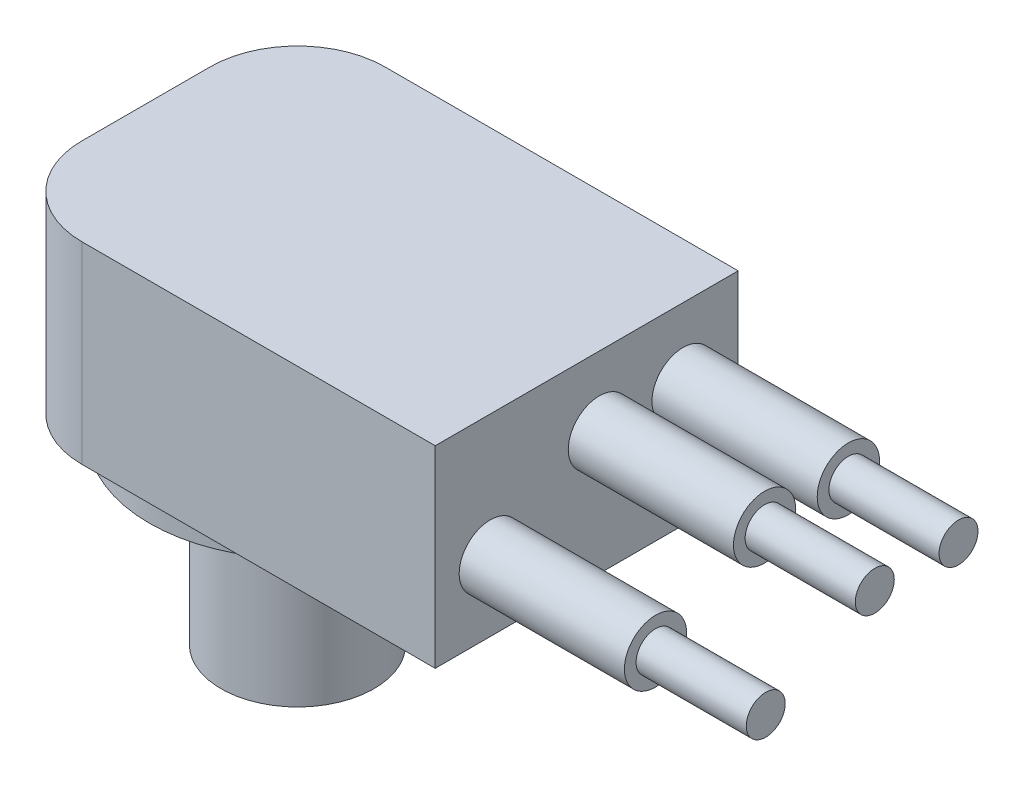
ISO-10303-21;
HEADER;
FILE_DESCRIPTION(('STEP AP214'),'2;1');
FILE_NAME('part.step','',(''),(''),'','','');
FILE_SCHEMA(('AUTOMOTIVE_DESIGN { 1 0 10303 214 1 1 1 1 }'));
ENDSEC;
DATA;
#1=APPLICATION_CONTEXT('core data for automotive mechanical design processes');
#2=APPLICATION_PROTOCOL_DEFINITION('international standard','automotive_design',2000,#1);
#3=PRODUCT_CONTEXT('',#1,'mechanical');
#4=PRODUCT('Part','Part','',(#3));
#5=PRODUCT_RELATED_PRODUCT_CATEGORY('part','',(#4));
#6=PRODUCT_DEFINITION_FORMATION('','',#4);
#7=PRODUCT_DEFINITION_CONTEXT('part definition',#1,'design');
#8=PRODUCT_DEFINITION('design','',#6,#7);
#9=PRODUCT_DEFINITION_SHAPE('','',#8);
#10=(LENGTH_UNIT() NAMED_UNIT(*) SI_UNIT(.MILLI.,.METRE.));
#11=(NAMED_UNIT(*) PLANE_ANGLE_UNIT() SI_UNIT($,.RADIAN.));
#12=(NAMED_UNIT(*) SI_UNIT($,.STERADIAN.) SOLID_ANGLE_UNIT());
#13=UNCERTAINTY_MEASURE_WITH_UNIT(LENGTH_MEASURE(1.E-05),#10,'distance_accuracy_value','');
#14=(GEOMETRIC_REPRESENTATION_CONTEXT(3) GLOBAL_UNCERTAINTY_ASSIGNED_CONTEXT((#13)) GLOBAL_UNIT_ASSIGNED_CONTEXT((#10,
#11,#12)) REPRESENTATION_CONTEXT('',''));
#15=CARTESIAN_POINT('',(0.,0.,0.));
#16=DIRECTION('',(0.,0.,1.));
#17=DIRECTION('',(1.,0.,0.));
#18=AXIS2_PLACEMENT_3D('',#15,#16,#17);
#19=CARTESIAN_POINT('',(11.,-1.5,0.));
#20=DIRECTION('',(0.,-1.,0.));
#21=DIRECTION('',(0.,0.,-1.));
#22=AXIS2_PLACEMENT_3D('',#19,#20,#21);
#23=PLANE('',#22);
#24=CARTESIAN_POINT('',(11.,-1.5,0.));
#25=DIRECTION('',(0.,-1.,0.));
#26=DIRECTION('',(0.,0.,-1.));
#27=AXIS2_PLACEMENT_3D('',#24,#25,#26);
#28=CIRCLE('',#27,10.755);
#29=CARTESIAN_POINT('',(11.,-1.5,-10.755));
#30=VERTEX_POINT('',#29);
#31=EDGE_CURVE('E129',#30,#30,#28,.T.);
#32=ORIENTED_EDGE('',*,*,#31,.T.);
#33=EDGE_LOOP('',(#32));
#34=FACE_BOUND('',#33,.T.);
#35=CARTESIAN_POINT('',(11.,-1.5,0.));
#36=DIRECTION('',(0.,-1.,0.));
#37=DIRECTION('',(0.,0.,-1.));
#38=AXIS2_PLACEMENT_3D('',#35,#36,#37);
#39=CIRCLE('',#38,7.99);
#40=CARTESIAN_POINT('',(11.,-1.5,-7.99));
#41=VERTEX_POINT('',#40);
#42=EDGE_CURVE('E42',#41,#41,#39,.F.);
#43=ORIENTED_EDGE('',*,*,#42,.T.);
#44=EDGE_LOOP('',(#43));
#45=FACE_BOUND('',#44,.T.);
#46=ADVANCED_FACE('F38',(#34,#45),#23,.T.);
#47=CARTESIAN_POINT('',(0.,0.,11.));
#48=DIRECTION('',(0.,1.,0.));
#49=DIRECTION('',(0.,0.,1.));
#50=AXIS2_PLACEMENT_3D('',#47,#48,#49);
#51=PLANE('',#50);
#52=DIRECTION('',(1.,0.,0.));
#53=VECTOR('',#52,1.);
#54=CARTESIAN_POINT('',(0.,0.,11.));
#55=LINE('',#54,#53);
#56=CARTESIAN_POINT('',(6.35,0.,11.));
#57=VERTEX_POINT('',#56);
#58=CARTESIAN_POINT('',(32.,0.,11.));
#59=VERTEX_POINT('',#58);
#60=EDGE_CURVE('E96',#57,#59,#55,.T.);
#61=ORIENTED_EDGE('',*,*,#60,.F.);
#62=CARTESIAN_POINT('',(6.35,0.,4.65));
#63=DIRECTION('',(0.,1.,0.));
#64=DIRECTION('',(0.,0.,1.));
#65=AXIS2_PLACEMENT_3D('',#62,#63,#64);
#66=CIRCLE('',#65,6.35);
#67=CARTESIAN_POINT('',(0.,0.,4.65));
#68=VERTEX_POINT('',#67);
#69=EDGE_CURVE('E142',#57,#68,#66,.F.);
#70=ORIENTED_EDGE('',*,*,#69,.T.);
#71=DIRECTION('',(0.,0.,-1.));
#72=VECTOR('',#71,1.);
#73=CARTESIAN_POINT('',(0.,0.,11.));
#74=LINE('',#73,#72);
#75=CARTESIAN_POINT('',(0.,0.,-4.65));
#76=VERTEX_POINT('',#75);
#77=EDGE_CURVE('E115',#68,#76,#74,.T.);
#78=ORIENTED_EDGE('',*,*,#77,.T.);
#79=CARTESIAN_POINT('',(6.35,0.,-4.65));
#80=DIRECTION('',(0.,1.,0.));
#81=DIRECTION('',(0.,0.,1.));
#82=AXIS2_PLACEMENT_3D('',#79,#80,#81);
#83=CIRCLE('',#82,6.35);
#84=CARTESIAN_POINT('',(6.35,0.,-11.));
#85=VERTEX_POINT('',#84);
#86=EDGE_CURVE('E140',#76,#85,#83,.F.);
#87=ORIENTED_EDGE('',*,*,#86,.T.);
#88=DIRECTION('',(1.,0.,0.));
#89=VECTOR('',#88,1.);
#90=CARTESIAN_POINT('',(0.,0.,-11.));
#91=LINE('',#90,#89);
#92=CARTESIAN_POINT('',(32.,0.,-11.));
#93=VERTEX_POINT('',#92);
#94=EDGE_CURVE('E112',#85,#93,#91,.T.);
#95=ORIENTED_EDGE('',*,*,#94,.T.);
#96=DIRECTION('',(0.,0.,-1.));
#97=VECTOR('',#96,1.);
#98=CARTESIAN_POINT('',(32.,0.,11.));
#99=LINE('',#98,#97);
#100=EDGE_CURVE('E109',#59,#93,#99,.T.);
#101=ORIENTED_EDGE('',*,*,#100,.F.);
#102=EDGE_LOOP('',(#61,#70,#78,#87,#95,#101));
#103=FACE_BOUND('',#102,.T.);
#104=CARTESIAN_POINT('',(11.,0.,0.));
#105=DIRECTION('',(0.,1.,0.));
#106=DIRECTION('',(0.,0.,1.));
#107=AXIS2_PLACEMENT_3D('',#104,#105,#106);
#108=CIRCLE('',#107,10.755);
#109=CARTESIAN_POINT('',(11.,0.,10.755));
#110=VERTEX_POINT('',#109);
#111=EDGE_CURVE('E136',#110,#110,#108,.F.);
#112=ORIENTED_EDGE('',*,*,#111,.F.);
#113=EDGE_LOOP('',(#112));
#114=FACE_BOUND('',#113,.T.);
#115=ADVANCED_FACE('F110',(#103,#114),#51,.F.);
#116=CARTESIAN_POINT('',(0.,0.,11.));
#117=DIRECTION('',(1.,0.,0.));
#118=DIRECTION('',(0.,0.,-1.));
#119=AXIS2_PLACEMENT_3D('',#116,#117,#118);
#120=PLANE('',#119);
#121=ORIENTED_EDGE('',*,*,#77,.F.);
#122=DIRECTION('',(0.,-1.,0.));
#123=VECTOR('',#122,1.);
#124=CARTESIAN_POINT('',(0.,0.,4.65));
#125=LINE('',#124,#123);
#126=CARTESIAN_POINT('',(0.,14.,4.65));
#127=VERTEX_POINT('',#126);
#128=EDGE_CURVE('E147',#68,#127,#125,.F.);
#129=ORIENTED_EDGE('',*,*,#128,.T.);
#130=DIRECTION('',(0.,0.,-1.));
#131=VECTOR('',#130,1.);
#132=CARTESIAN_POINT('',(0.,14.,11.));
#133=LINE('',#132,#131);
#134=CARTESIAN_POINT('',(0.,14.,-4.65));
#135=VERTEX_POINT('',#134);
#136=EDGE_CURVE('E123',#127,#135,#133,.T.);
#137=ORIENTED_EDGE('',*,*,#136,.T.);
#138=DIRECTION('',(0.,-1.,0.));
#139=VECTOR('',#138,1.);
#140=CARTESIAN_POINT('',(0.,0.,-4.65));
#141=LINE('',#140,#139);
#142=EDGE_CURVE('E144',#135,#76,#141,.T.);
#143=ORIENTED_EDGE('',*,*,#142,.T.);
#144=EDGE_LOOP('',(#121,#129,#137,#143));
#145=FACE_BOUND('',#144,.T.);
#146=ADVANCED_FACE('F211',(#145),#120,.F.);
#147=CARTESIAN_POINT('',(32.,0.,11.));
#148=DIRECTION('',(-1.,0.,0.));
#149=DIRECTION('',(0.,0.,1.));
#150=AXIS2_PLACEMENT_3D('',#147,#148,#149);
#151=PLANE('',#150);
#152=CARTESIAN_POINT('',(32.,8.92,-0.919999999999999));
#153=DIRECTION('',(-1.,0.,0.));
#154=DIRECTION('',(0.,0.,1.));
#155=AXIS2_PLACEMENT_3D('',#152,#153,#154);
#156=CIRCLE('',#155,2.261);
#157=CARTESIAN_POINT('',(32.,8.92,1.341));
#158=VERTEX_POINT('',#157);
#159=EDGE_CURVE('E11',#158,#158,#156,.F.);
#160=ORIENTED_EDGE('',*,*,#159,.F.);
#161=EDGE_LOOP('',(#160));
#162=FACE_BOUND('',#161,.T.);
#163=CARTESIAN_POINT('',(32.,5.08,7.));
#164=DIRECTION('',(-1.,0.,0.));
#165=DIRECTION('',(0.,0.,1.));
#166=AXIS2_PLACEMENT_3D('',#163,#164,#165);
#167=CIRCLE('',#166,2.261);
#168=CARTESIAN_POINT('',(32.,5.08,9.261));
#169=VERTEX_POINT('',#168);
#170=EDGE_CURVE('E47',#169,#169,#167,.F.);
#171=ORIENTED_EDGE('',*,*,#170,.F.);
#172=EDGE_LOOP('',(#171));
#173=FACE_BOUND('',#172,.T.);
#174=CARTESIAN_POINT('',(32.,8.92,-7.));
#175=DIRECTION('',(-1.,0.,0.));
#176=DIRECTION('',(0.,0.,1.));
#177=AXIS2_PLACEMENT_3D('',#174,#175,#176);
#178=CIRCLE('',#177,2.261);
#179=CARTESIAN_POINT('',(32.,8.92,-4.739));
#180=VERTEX_POINT('',#179);
#181=EDGE_CURVE('E153',#180,#180,#178,.F.);
#182=ORIENTED_EDGE('',*,*,#181,.F.);
#183=EDGE_LOOP('',(#182));
#184=FACE_BOUND('',#183,.T.);
#185=DIRECTION('',(0.,1.,0.));
#186=VECTOR('',#185,1.);
#187=CARTESIAN_POINT('',(32.,0.,-11.));
#188=LINE('',#187,#186);
#189=CARTESIAN_POINT('',(32.,14.,-11.));
#190=VERTEX_POINT('',#189);
#191=EDGE_CURVE('E128',#93,#190,#188,.T.);
#192=ORIENTED_EDGE('',*,*,#191,.T.);
#193=DIRECTION('',(0.,0.,-1.));
#194=VECTOR('',#193,1.);
#195=CARTESIAN_POINT('',(32.,14.,11.));
#196=LINE('',#195,#194);
#197=CARTESIAN_POINT('',(32.,14.,11.));
#198=VERTEX_POINT('',#197);
#199=EDGE_CURVE('E116',#198,#190,#196,.T.);
#200=ORIENTED_EDGE('',*,*,#199,.F.);
#201=DIRECTION('',(0.,1.,0.));
#202=VECTOR('',#201,1.);
#203=CARTESIAN_POINT('',(32.,0.,11.));
#204=LINE('',#203,#202);
#205=EDGE_CURVE('E101',#59,#198,#204,.T.);
#206=ORIENTED_EDGE('',*,*,#205,.F.);
#207=ORIENTED_EDGE('',*,*,#100,.T.);
#208=EDGE_LOOP('',(#192,#200,#206,#207));
#209=FACE_BOUND('',#208,.T.);
#210=ADVANCED_FACE('F118',(#162,#173,#184,#209),#151,.F.);
#211=CARTESIAN_POINT('',(0.,14.,11.));
#212=DIRECTION('',(0.,-1.,0.));
#213=DIRECTION('',(0.,0.,-1.));
#214=AXIS2_PLACEMENT_3D('',#211,#212,#213);
#215=PLANE('',#214);
#216=ORIENTED_EDGE('',*,*,#136,.F.);
#217=CARTESIAN_POINT('',(6.35,14.,4.65));
#218=DIRECTION('',(0.,-1.,0.));
#219=DIRECTION('',(0.,0.,-1.));
#220=AXIS2_PLACEMENT_3D('',#217,#218,#219);
#221=CIRCLE('',#220,6.35);
#222=CARTESIAN_POINT('',(6.35,14.,11.));
#223=VERTEX_POINT('',#222);
#224=EDGE_CURVE('E150',#127,#223,#221,.F.);
#225=ORIENTED_EDGE('',*,*,#224,.T.);
#226=DIRECTION('',(-1.,0.,0.));
#227=VECTOR('',#226,1.);
#228=CARTESIAN_POINT('',(0.,14.,11.));
#229=LINE('',#228,#227);
#230=EDGE_CURVE('E121',#198,#223,#229,.T.);
#231=ORIENTED_EDGE('',*,*,#230,.F.);
#232=ORIENTED_EDGE('',*,*,#199,.T.);
#233=DIRECTION('',(-1.,0.,0.));
#234=VECTOR('',#233,1.);
#235=CARTESIAN_POINT('',(0.,14.,-11.));
#236=LINE('',#235,#234);
#237=CARTESIAN_POINT('',(6.35,14.,-11.));
#238=VERTEX_POINT('',#237);
#239=EDGE_CURVE('E106',#190,#238,#236,.T.);
#240=ORIENTED_EDGE('',*,*,#239,.T.);
#241=CARTESIAN_POINT('',(6.35,14.,-4.65));
#242=DIRECTION('',(0.,-1.,0.));
#243=DIRECTION('',(0.,0.,-1.));
#244=AXIS2_PLACEMENT_3D('',#241,#242,#243);
#245=CIRCLE('',#244,6.35);
#246=EDGE_CURVE('E62',#238,#135,#245,.F.);
#247=ORIENTED_EDGE('',*,*,#246,.T.);
#248=EDGE_LOOP('',(#216,#225,#231,#232,#240,#247));
#249=FACE_BOUND('',#248,.T.);
#250=ADVANCED_FACE('F232',(#249),#215,.F.);
#251=CARTESIAN_POINT('',(0.,14.,11.));
#252=DIRECTION('',(0.,0.,-1.));
#253=DIRECTION('',(-1.,0.,0.));
#254=AXIS2_PLACEMENT_3D('',#251,#252,#253);
#255=PLANE('',#254);
#256=ORIENTED_EDGE('',*,*,#230,.T.);
#257=DIRECTION('',(0.,-1.,0.));
#258=VECTOR('',#257,1.);
#259=CARTESIAN_POINT('',(6.35,14.,11.));
#260=LINE('',#259,#258);
#261=EDGE_CURVE('E104',#223,#57,#260,.T.);
#262=ORIENTED_EDGE('',*,*,#261,.T.);
#263=ORIENTED_EDGE('',*,*,#60,.T.);
#264=ORIENTED_EDGE('',*,*,#205,.T.);
#265=EDGE_LOOP('',(#256,#262,#263,#264));
#266=FACE_BOUND('',#265,.T.);
#267=ADVANCED_FACE('F99',(#266),#255,.F.);
#268=CARTESIAN_POINT('',(0.,14.,-11.));
#269=DIRECTION('',(0.,0.,-1.));
#270=DIRECTION('',(-1.,0.,0.));
#271=AXIS2_PLACEMENT_3D('',#268,#269,#270);
#272=PLANE('',#271);
#273=ORIENTED_EDGE('',*,*,#94,.F.);
#274=DIRECTION('',(0.,-1.,0.));
#275=VECTOR('',#274,1.);
#276=CARTESIAN_POINT('',(6.35,14.,-11.));
#277=LINE('',#276,#275);
#278=EDGE_CURVE('E55',#85,#238,#277,.F.);
#279=ORIENTED_EDGE('',*,*,#278,.T.);
#280=ORIENTED_EDGE('',*,*,#239,.F.);
#281=ORIENTED_EDGE('',*,*,#191,.F.);
#282=EDGE_LOOP('',(#273,#279,#280,#281));
#283=FACE_BOUND('',#282,.T.);
#284=ADVANCED_FACE('F207',(#283),#272,.T.);
#285=CARTESIAN_POINT('',(11.,-1.5,0.));
#286=DIRECTION('',(0.,1.,0.));
#287=DIRECTION('',(0.,0.,1.));
#288=AXIS2_PLACEMENT_3D('',#285,#286,#287);
#289=CYLINDRICAL_SURFACE('',#288,10.755);
#290=ORIENTED_EDGE('',*,*,#31,.F.);
#291=EDGE_LOOP('',(#290));
#292=FACE_BOUND('',#291,.T.);
#293=ORIENTED_EDGE('',*,*,#111,.T.);
#294=EDGE_LOOP('',(#293));
#295=FACE_BOUND('',#294,.T.);
#296=ADVANCED_FACE('F203',(#292,#295),#289,.T.);
#297=CARTESIAN_POINT('',(6.35,14.,4.65));
#298=DIRECTION('',(0.,-1.,0.));
#299=DIRECTION('',(0.,0.,-1.));
#300=AXIS2_PLACEMENT_3D('',#297,#298,#299);
#301=CYLINDRICAL_SURFACE('',#300,6.35);
#302=ORIENTED_EDGE('',*,*,#224,.F.);
#303=ORIENTED_EDGE('',*,*,#128,.F.);
#304=ORIENTED_EDGE('',*,*,#69,.F.);
#305=ORIENTED_EDGE('',*,*,#261,.F.);
#306=EDGE_LOOP('',(#302,#303,#304,#305));
#307=FACE_BOUND('',#306,.T.);
#308=ADVANCED_FACE('F206',(#307),#301,.T.);
#309=CARTESIAN_POINT('',(6.35,0.,-4.65));
#310=DIRECTION('',(0.,1.,0.));
#311=DIRECTION('',(0.,0.,1.));
#312=AXIS2_PLACEMENT_3D('',#309,#310,#311);
#313=CYLINDRICAL_SURFACE('',#312,6.35);
#314=ORIENTED_EDGE('',*,*,#246,.F.);
#315=ORIENTED_EDGE('',*,*,#278,.F.);
#316=ORIENTED_EDGE('',*,*,#86,.F.);
#317=ORIENTED_EDGE('',*,*,#142,.F.);
#318=EDGE_LOOP('',(#314,#315,#316,#317));
#319=FACE_BOUND('',#318,.T.);
#320=ADVANCED_FACE('F40',(#319),#313,.T.);
#321=CARTESIAN_POINT('',(44.,8.92,-7.));
#322=DIRECTION('',(-1.,0.,0.));
#323=DIRECTION('',(0.,0.,1.));
#324=AXIS2_PLACEMENT_3D('',#321,#322,#323);
#325=CYLINDRICAL_SURFACE('',#324,2.261);
#326=CARTESIAN_POINT('',(44.,8.92,-7.));
#327=DIRECTION('',(1.,0.,0.));
#328=DIRECTION('',(0.,0.,-1.));
#329=AXIS2_PLACEMENT_3D('',#326,#327,#328);
#330=CIRCLE('',#329,2.261);
#331=CARTESIAN_POINT('',(44.,8.92,-9.261));
#332=VERTEX_POINT('',#331);
#333=EDGE_CURVE('E191',#332,#332,#330,.T.);
#334=ORIENTED_EDGE('',*,*,#333,.F.);
#335=EDGE_LOOP('',(#334));
#336=FACE_BOUND('',#335,.T.);
#337=ORIENTED_EDGE('',*,*,#181,.T.);
#338=EDGE_LOOP('',(#337));
#339=FACE_BOUND('',#338,.T.);
#340=ADVANCED_FACE('F228',(#336,#339),#325,.T.);
#341=CARTESIAN_POINT('',(44.,8.92,-7.));
#342=DIRECTION('',(1.,0.,0.));
#343=DIRECTION('',(0.,0.,-1.));
#344=AXIS2_PLACEMENT_3D('',#341,#342,#343);
#345=PLANE('',#344);
#346=CARTESIAN_POINT('',(44.,8.92,-7.));
#347=DIRECTION('',(1.,0.,0.));
#348=DIRECTION('',(0.,0.,-1.));
#349=AXIS2_PLACEMENT_3D('',#346,#347,#348);
#350=CIRCLE('',#349,1.415);
#351=CARTESIAN_POINT('',(44.,8.92,-8.415));
#352=VERTEX_POINT('',#351);
#353=EDGE_CURVE('E177',#352,#352,#350,.T.);
#354=ORIENTED_EDGE('',*,*,#353,.F.);
#355=EDGE_LOOP('',(#354));
#356=FACE_BOUND('',#355,.T.);
#357=ORIENTED_EDGE('',*,*,#333,.T.);
#358=EDGE_LOOP('',(#357));
#359=FACE_BOUND('',#358,.T.);
#360=ADVANCED_FACE('F255',(#356,#359),#345,.T.);
#361=CARTESIAN_POINT('',(44.,5.08,7.));
#362=DIRECTION('',(-1.,0.,0.));
#363=DIRECTION('',(0.,0.,1.));
#364=AXIS2_PLACEMENT_3D('',#361,#362,#363);
#365=CYLINDRICAL_SURFACE('',#364,2.261);
#366=CARTESIAN_POINT('',(44.,5.08,7.));
#367=DIRECTION('',(1.,0.,0.));
#368=DIRECTION('',(0.,0.,-1.));
#369=AXIS2_PLACEMENT_3D('',#366,#367,#368);
#370=CIRCLE('',#369,2.261);
#371=CARTESIAN_POINT('',(44.,5.08,4.739));
#372=VERTEX_POINT('',#371);
#373=EDGE_CURVE('E188',#372,#372,#370,.T.);
#374=ORIENTED_EDGE('',*,*,#373,.F.);
#375=EDGE_LOOP('',(#374));
#376=FACE_BOUND('',#375,.T.);
#377=ORIENTED_EDGE('',*,*,#170,.T.);
#378=EDGE_LOOP('',(#377));
#379=FACE_BOUND('',#378,.T.);
#380=ADVANCED_FACE('F261',(#376,#379),#365,.T.);
#381=CARTESIAN_POINT('',(44.,5.08,7.));
#382=DIRECTION('',(1.,0.,0.));
#383=DIRECTION('',(0.,0.,-1.));
#384=AXIS2_PLACEMENT_3D('',#381,#382,#383);
#385=PLANE('',#384);
#386=CARTESIAN_POINT('',(44.,5.08,7.));
#387=DIRECTION('',(1.,0.,0.));
#388=DIRECTION('',(0.,0.,-1.));
#389=AXIS2_PLACEMENT_3D('',#386,#387,#388);
#390=CIRCLE('',#389,1.415);
#391=CARTESIAN_POINT('',(44.,5.08,5.585));
#392=VERTEX_POINT('',#391);
#393=EDGE_CURVE('E171',#392,#392,#390,.T.);
#394=ORIENTED_EDGE('',*,*,#393,.F.);
#395=EDGE_LOOP('',(#394));
#396=FACE_BOUND('',#395,.T.);
#397=ORIENTED_EDGE('',*,*,#373,.T.);
#398=EDGE_LOOP('',(#397));
#399=FACE_BOUND('',#398,.T.);
#400=ADVANCED_FACE('F377',(#396,#399),#385,.T.);
#401=CARTESIAN_POINT('',(44.,8.92,-0.919999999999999));
#402=DIRECTION('',(-1.,0.,0.));
#403=DIRECTION('',(0.,0.,1.));
#404=AXIS2_PLACEMENT_3D('',#401,#402,#403);
#405=CYLINDRICAL_SURFACE('',#404,2.261);
#406=CARTESIAN_POINT('',(44.,8.92,-0.919999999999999));
#407=DIRECTION('',(1.,0.,0.));
#408=DIRECTION('',(0.,0.,-1.));
#409=AXIS2_PLACEMENT_3D('',#406,#407,#408);
#410=CIRCLE('',#409,2.261);
#411=CARTESIAN_POINT('',(44.,8.92,-3.181));
#412=VERTEX_POINT('',#411);
#413=EDGE_CURVE('E183',#412,#412,#410,.T.);
#414=ORIENTED_EDGE('',*,*,#413,.F.);
#415=EDGE_LOOP('',(#414));
#416=FACE_BOUND('',#415,.T.);
#417=ORIENTED_EDGE('',*,*,#159,.T.);
#418=EDGE_LOOP('',(#417));
#419=FACE_BOUND('',#418,.T.);
#420=ADVANCED_FACE('F369',(#416,#419),#405,.T.);
#421=CARTESIAN_POINT('',(44.,8.92,-0.919999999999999));
#422=DIRECTION('',(1.,0.,0.));
#423=DIRECTION('',(0.,0.,-1.));
#424=AXIS2_PLACEMENT_3D('',#421,#422,#423);
#425=PLANE('',#424);
#426=CARTESIAN_POINT('',(44.,8.92,-0.919999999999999));
#427=DIRECTION('',(1.,0.,0.));
#428=DIRECTION('',(0.,0.,-1.));
#429=AXIS2_PLACEMENT_3D('',#426,#427,#428);
#430=CIRCLE('',#429,1.415);
#431=CARTESIAN_POINT('',(44.,8.92,-2.335));
#432=VERTEX_POINT('',#431);
#433=EDGE_CURVE('E162',#432,#432,#430,.T.);
#434=ORIENTED_EDGE('',*,*,#433,.F.);
#435=EDGE_LOOP('',(#434));
#436=FACE_BOUND('',#435,.T.);
#437=ORIENTED_EDGE('',*,*,#413,.T.);
#438=EDGE_LOOP('',(#437));
#439=FACE_BOUND('',#438,.T.);
#440=ADVANCED_FACE('F359',(#436,#439),#425,.T.);
#441=CARTESIAN_POINT('',(52.,8.92,-7.));
#442=DIRECTION('',(-1.,0.,0.));
#443=DIRECTION('',(0.,0.,1.));
#444=AXIS2_PLACEMENT_3D('',#441,#442,#443);
#445=CYLINDRICAL_SURFACE('',#444,1.415);
#446=CARTESIAN_POINT('',(52.,8.92,-7.));
#447=DIRECTION('',(1.,0.,0.));
#448=DIRECTION('',(0.,0.,-1.));
#449=AXIS2_PLACEMENT_3D('',#446,#447,#448);
#450=CIRCLE('',#449,1.415);
#451=CARTESIAN_POINT('',(52.,8.92,-8.415));
#452=VERTEX_POINT('',#451);
#453=EDGE_CURVE('E180',#452,#452,#450,.T.);
#454=ORIENTED_EDGE('',*,*,#453,.F.);
#455=EDGE_LOOP('',(#454));
#456=FACE_BOUND('',#455,.T.);
#457=ORIENTED_EDGE('',*,*,#353,.T.);
#458=EDGE_LOOP('',(#457));
#459=FACE_BOUND('',#458,.T.);
#460=ADVANCED_FACE('F349',(#456,#459),#445,.T.);
#461=CARTESIAN_POINT('',(52.,8.92,-7.));
#462=DIRECTION('',(1.,0.,0.));
#463=DIRECTION('',(0.,0.,-1.));
#464=AXIS2_PLACEMENT_3D('',#461,#462,#463);
#465=PLANE('',#464);
#466=ORIENTED_EDGE('',*,*,#453,.T.);
#467=EDGE_LOOP('',(#466));
#468=FACE_BOUND('',#467,.T.);
#469=ADVANCED_FACE('F339',(#468),#465,.T.);
#470=CARTESIAN_POINT('',(52.,5.08,7.));
#471=DIRECTION('',(-1.,0.,0.));
#472=DIRECTION('',(0.,0.,1.));
#473=AXIS2_PLACEMENT_3D('',#470,#471,#472);
#474=CYLINDRICAL_SURFACE('',#473,1.415);
#475=CARTESIAN_POINT('',(52.,5.08,7.));
#476=DIRECTION('',(1.,0.,0.));
#477=DIRECTION('',(0.,0.,-1.));
#478=AXIS2_PLACEMENT_3D('',#475,#476,#477);
#479=CIRCLE('',#478,1.415);
#480=CARTESIAN_POINT('',(52.,5.08,5.585));
#481=VERTEX_POINT('',#480);
#482=EDGE_CURVE('E174',#481,#481,#479,.T.);
#483=ORIENTED_EDGE('',*,*,#482,.F.);
#484=EDGE_LOOP('',(#483));
#485=FACE_BOUND('',#484,.T.);
#486=ORIENTED_EDGE('',*,*,#393,.T.);
#487=EDGE_LOOP('',(#486));
#488=FACE_BOUND('',#487,.T.);
#489=ADVANCED_FACE('F329',(#485,#488),#474,.T.);
#490=CARTESIAN_POINT('',(52.,5.08,7.));
#491=DIRECTION('',(1.,0.,0.));
#492=DIRECTION('',(0.,0.,-1.));
#493=AXIS2_PLACEMENT_3D('',#490,#491,#492);
#494=PLANE('',#493);
#495=ORIENTED_EDGE('',*,*,#482,.T.);
#496=EDGE_LOOP('',(#495));
#497=FACE_BOUND('',#496,.T.);
#498=ADVANCED_FACE('F319',(#497),#494,.T.);
#499=CARTESIAN_POINT('',(52.,8.92,-0.919999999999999));
#500=DIRECTION('',(-1.,0.,0.));
#501=DIRECTION('',(0.,0.,1.));
#502=AXIS2_PLACEMENT_3D('',#499,#500,#501);
#503=CYLINDRICAL_SURFACE('',#502,1.415);
#504=CARTESIAN_POINT('',(52.,8.92,-0.919999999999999));
#505=DIRECTION('',(1.,0.,0.));
#506=DIRECTION('',(0.,0.,-1.));
#507=AXIS2_PLACEMENT_3D('',#504,#505,#506);
#508=CIRCLE('',#507,1.415);
#509=CARTESIAN_POINT('',(52.,8.92,-2.335));
#510=VERTEX_POINT('',#509);
#511=EDGE_CURVE('E166',#510,#510,#508,.T.);
#512=ORIENTED_EDGE('',*,*,#511,.F.);
#513=EDGE_LOOP('',(#512));
#514=FACE_BOUND('',#513,.T.);
#515=ORIENTED_EDGE('',*,*,#433,.T.);
#516=EDGE_LOOP('',(#515));
#517=FACE_BOUND('',#516,.T.);
#518=ADVANCED_FACE('F309',(#514,#517),#503,.T.);
#519=CARTESIAN_POINT('',(52.,8.92,-0.919999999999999));
#520=DIRECTION('',(1.,0.,0.));
#521=DIRECTION('',(0.,0.,-1.));
#522=AXIS2_PLACEMENT_3D('',#519,#520,#521);
#523=PLANE('',#522);
#524=ORIENTED_EDGE('',*,*,#511,.T.);
#525=EDGE_LOOP('',(#524));
#526=FACE_BOUND('',#525,.T.);
#527=ADVANCED_FACE('F295',(#526),#523,.T.);
#528=CARTESIAN_POINT('',(11.,-1.5,0.));
#529=DIRECTION('',(0.,1.,0.));
#530=DIRECTION('',(0.,0.,1.));
#531=AXIS2_PLACEMENT_3D('',#528,#529,#530);
#532=TOROIDAL_SURFACE('',#531,7.1,0.89);
#533=ORIENTED_EDGE('',*,*,#42,.F.);
#534=EDGE_LOOP('',(#533));
#535=FACE_BOUND('',#534,.T.);
#536=CARTESIAN_POINT('',(11.,-1.5,0.));
#537=DIRECTION('',(0.,1.,0.));
#538=DIRECTION('',(0.,0.,1.));
#539=AXIS2_PLACEMENT_3D('',#536,#537,#538);
#540=CIRCLE('',#539,6.21);
#541=CARTESIAN_POINT('',(11.,-1.5,6.21));
#542=VERTEX_POINT('',#541);
#543=EDGE_CURVE('E157',#542,#542,#540,.F.);
#544=ORIENTED_EDGE('',*,*,#543,.F.);
#545=EDGE_LOOP('',(#544));
#546=FACE_BOUND('',#545,.T.);
#547=ADVANCED_FACE('F271',(#535,#546),#532,.T.);
#548=CARTESIAN_POINT('',(11.,-14.5048,0.));
#549=DIRECTION('',(0.,-1.,0.));
#550=DIRECTION('',(0.,0.,-1.));
#551=AXIS2_PLACEMENT_3D('',#548,#549,#550);
#552=PLANE('',#551);
#553=CARTESIAN_POINT('',(11.,-14.5048,0.));
#554=DIRECTION('',(0.,-1.,0.));
#555=DIRECTION('',(0.,0.,-1.));
#556=AXIS2_PLACEMENT_3D('',#553,#554,#555);
#557=CIRCLE('',#556,5.55625);
#558=CARTESIAN_POINT('',(11.,-14.5048,-5.55625));
#559=VERTEX_POINT('',#558);
#560=EDGE_CURVE('E195',#559,#559,#557,.T.);
#561=ORIENTED_EDGE('',*,*,#560,.T.);
#562=EDGE_LOOP('',(#561));
#563=FACE_BOUND('',#562,.T.);
#564=ADVANCED_FACE('F267',(#563),#552,.T.);
#565=CARTESIAN_POINT('',(11.,-14.5048,0.));
#566=DIRECTION('',(0.,1.,0.));
#567=DIRECTION('',(0.,0.,1.));
#568=AXIS2_PLACEMENT_3D('',#565,#566,#567);
#569=CYLINDRICAL_SURFACE('',#568,5.55625);
#570=ORIENTED_EDGE('',*,*,#560,.F.);
#571=EDGE_LOOP('',(#570));
#572=FACE_BOUND('',#571,.T.);
#573=CARTESIAN_POINT('',(11.,-1.5,0.));
#574=DIRECTION('',(0.,-1.,0.));
#575=DIRECTION('',(0.,0.,-1.));
#576=AXIS2_PLACEMENT_3D('',#573,#574,#575);
#577=CIRCLE('',#576,5.55625);
#578=CARTESIAN_POINT('',(11.,-1.5,-5.55625));
#579=VERTEX_POINT('',#578);
#580=EDGE_CURVE('E194',#579,#579,#577,.T.);
#581=ORIENTED_EDGE('',*,*,#580,.T.);
#582=EDGE_LOOP('',(#581));
#583=FACE_BOUND('',#582,.T.);
#584=ADVANCED_FACE('F270',(#572,#583),#569,.T.);
#585=ORIENTED_EDGE('',*,*,#580,.F.);
#586=EDGE_LOOP('',(#585));
#587=FACE_BOUND('',#586,.T.);
#588=ORIENTED_EDGE('',*,*,#543,.T.);
#589=EDGE_LOOP('',(#588));
#590=FACE_BOUND('',#589,.T.);
#591=ADVANCED_FACE('F220',(#587,#590),#23,.T.);
#592=CLOSED_SHELL('',(#46,#115,#146,#210,#250,#267,#284,#296,#308,#320,#340,#360,#380,#400,#420,
#440,#460,#469,#489,#498,#518,#527,#547,#564,#584,#591));
#593=MANIFOLD_SOLID_BREP('B2',#592);
#594=ADVANCED_BREP_SHAPE_REPRESENTATION('',(#18,#593),#14);
#595=SHAPE_DEFINITION_REPRESENTATION(#9,#594);
ENDSEC;
END-ISO-10303-21;
